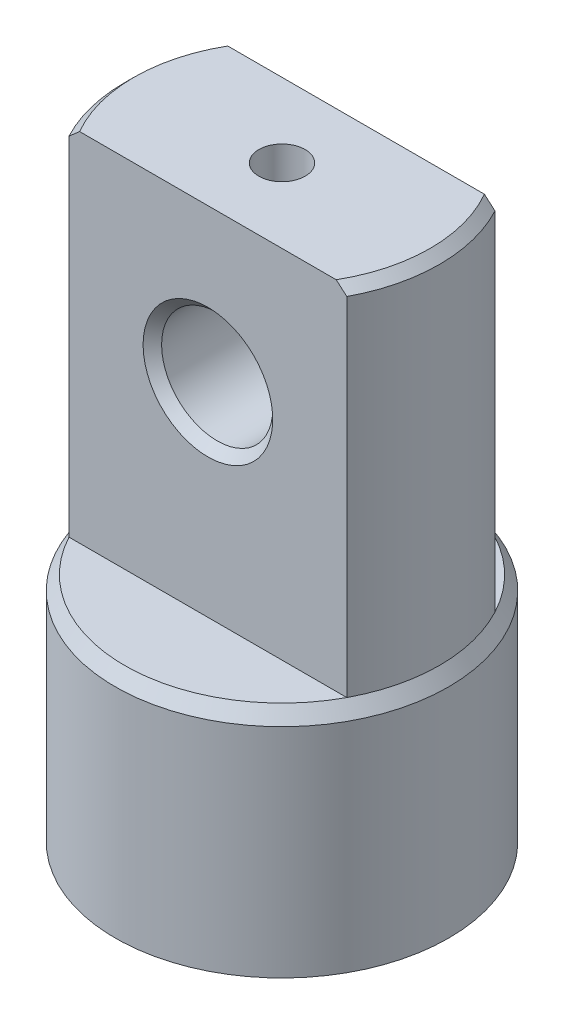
from build123d import *

# Parameters (mm, degrees)
CUT_EXTRUDE3_DEPTH         = 38.5
CHAMFER1_SIZE              = 1
F_12_0_12_DIAMETER_HOLE1_D = 12
CHAMFER2_SIZE              = 1
M6_TAPPED_HOLE1_REACH      = 70.412
M6_TAPPED_HOLE1_BORE_R     = 2.5


with BuildPart() as part:
    # Sketch1 → Revolve1 (revolve)
    with BuildSketch(Plane.XY):
        Polygon((0, 0), (18, 0), (18, 23.5), (17, 25), (17, 63.5), (0, 63.5), align=None)
    revolve(axis=Axis((0, 0, 0), (0, 1, 0)))

    # Sketch3 → Cut-Extrude3 (cut)
    with BuildSketch(Plane(origin=(0, 63.5, 0), x_dir=(-1, 0, 0), z_dir=(0, 1, 0))):
        with BuildLine():
            Line((16.124515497, -8), (-16.124515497, -8))
            ThreePointArc((-16.124515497, -8), (0, -18), (16.124515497, -8))
        make_face()
        with BuildLine():
            Line((16.124515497, 8), (-16.124515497, 8))
            ThreePointArc((-16.124515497, 8), (0, 18), (16.124515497, 8))
        make_face()
    extrude(amount=-CUT_EXTRUDE3_DEPTH, mode=Mode.SUBTRACT)

    # Chamfer1
    chamfer1_edges = [part.edges().sort_by_distance(p)[0] for p in [
        (17, 63.5, 0),
        (-17, 63.5, 0),
    ]]
    chamfer(chamfer1_edges, length=CHAMFER1_SIZE)

    # 12.0 _12_ Diameter Hole1 (through all)
    with Locations(Plane.XY.offset(8)):
        with Locations((0, 47)):
            Hole(F_12_0_12_DIAMETER_HOLE1_D / 2)

    # Chamfer2
    chamfer2_edges = [part.edges().sort_by_distance(p)[0] for p in [
        (6, 47, 8),
        (6, 47, -8),
    ]]
    chamfer(chamfer2_edges, length=CHAMFER2_SIZE)

    # M6 Tapped Hole1 bore → M6 Tapped Hole1 (cut, up to next)
    with BuildSketch(Plane(origin=(0, 63.5, 0), x_dir=(-1, 0, 0), z_dir=(0, 1, 0)), mode=Mode.PRIVATE) as m6_tapped_hole1_sk1:
        Circle(M6_TAPPED_HOLE1_BORE_R)
    m6_tapped_hole1_tool1 = extrude(m6_tapped_hole1_sk1.sketch, amount=-M6_TAPPED_HOLE1_REACH, mode=Mode.PRIVATE) & part.part
    add(m6_tapped_hole1_tool1.solids().sort_by_distance((0, 63.5, 0))[0], mode=Mode.SUBTRACT)


solid = part.part
